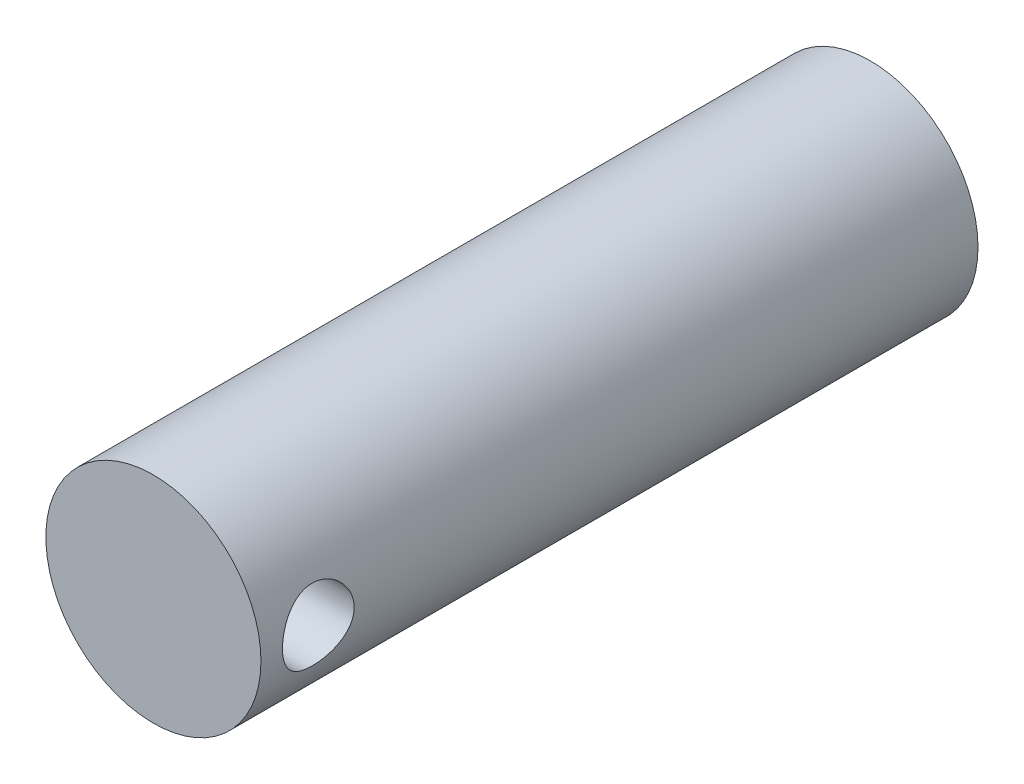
from build123d import *

# Parameters (mm, degrees)
SKETCH1_R           = 7.5
BOSS_EXTRUDE1_DEPTH = 50
SKETCH2_R           = 2.5
CUT_EXTRUDE1_DEPTH  = 25


with BuildPart() as part:
    # Sketch1 → Boss-Extrude1 (new body)
    with BuildSketch(Plane.XY):
        Circle(SKETCH1_R)
    extrude(amount=BOSS_EXTRUDE1_DEPTH)

    # Sketch2 → Cut-Extrude1 (cut, symmetric)
    with BuildSketch(Plane(origin=(0, 0, 0), x_dir=(0, 0, -1), z_dir=(1, 0, 0))):
        with Locations(Location((-46, 0, 0), (0, 0, 180))):
            Circle(SKETCH2_R)
    extrude(amount=CUT_EXTRUDE1_DEPTH, both=True, mode=Mode.SUBTRACT)


solid = part.part
